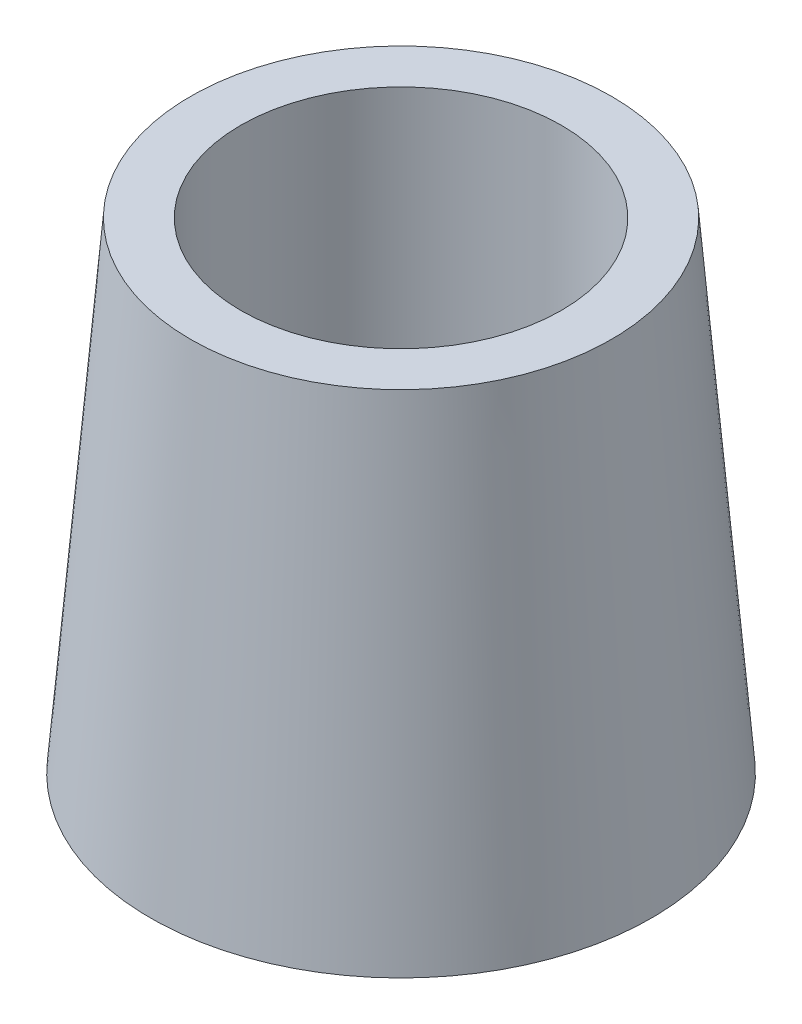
from build123d import *


with BuildPart() as part:
    # Sketch1 → Revolve1 (revolve)
    with BuildSketch(Plane.XY, mode=Mode.PRIVATE) as revolve1_sk:
        Polygon((8, 0), (8, 24), (10.5, 24), (12.5, 0), align=None)
    revolve(revolve1_sk.sketch.rotate(Axis((0, 0, 0), (0, 1, 0)), 90), axis=Axis((0, 0, 0), (0, 1, 0)))


solid = part.part
